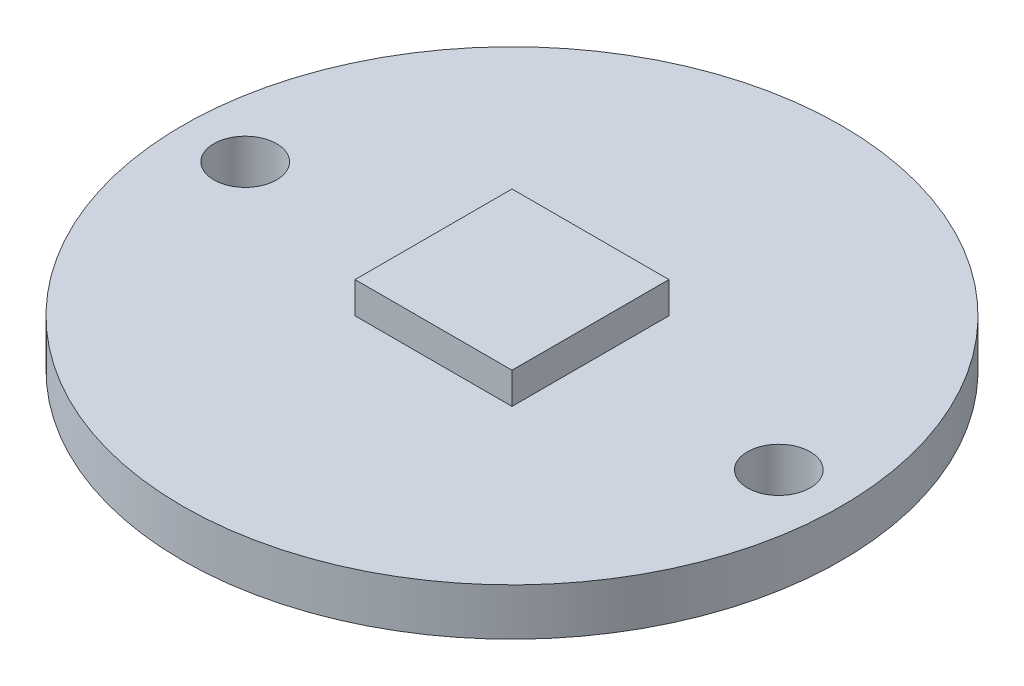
from build123d import *

# Parameters (mm, degrees)
SKETCH1_R           = 10.5
SKETCH1_R_2         = 1
BOSS_EXTRUDE1_DEPTH = 1.5
SKETCH2_W           = 5
SKETCH2_H           = 5
BOSS_EXTRUDE2_DEPTH = 1


with BuildPart() as part:
    # Sketch1 → Boss-Extrude1 (new body)
    with BuildSketch(Plane(origin=(0, 0, 0), x_dir=(1, 0, 0), z_dir=(0, 1, 0))):
        with Locations(Location((0, 0, 0), (0, 0, 270))):
            Circle(SKETCH1_R)
        with Locations(Location((-8.5, 0, 0), (0, 0, 270))):
            Circle(SKETCH1_R_2, mode=Mode.SUBTRACT)
        with Locations(Location((8.5, 0, 0), (0, 0, 270))):
            Circle(SKETCH1_R_2, mode=Mode.SUBTRACT)
    extrude(amount=BOSS_EXTRUDE1_DEPTH)

    # Sketch2 → Boss-Extrude2 (add)
    with BuildSketch(Plane(origin=(0, 1.5, 0), x_dir=(1, 0, 0), z_dir=(0, 1, 0))):
        Rectangle(SKETCH2_W, SKETCH2_H)
    extrude(amount=BOSS_EXTRUDE2_DEPTH)


solid = part.part
